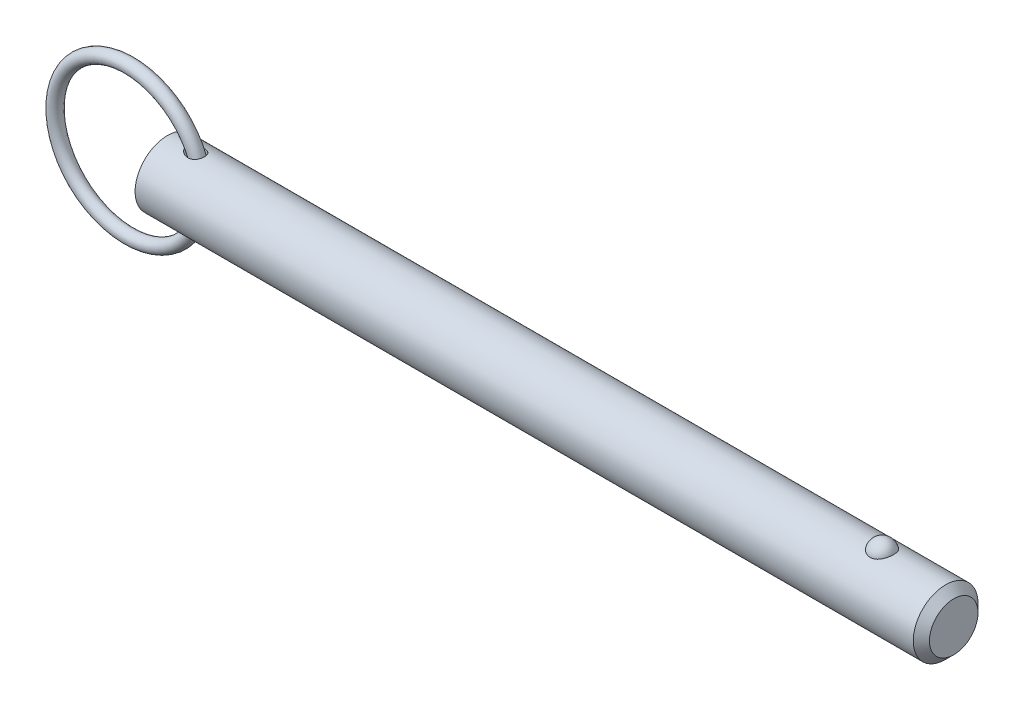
ISO-10303-21;
HEADER;
FILE_DESCRIPTION(('STEP AP214'),'2;1');
FILE_NAME('part.step','',(''),(''),'','','');
FILE_SCHEMA(('AUTOMOTIVE_DESIGN { 1 0 10303 214 1 1 1 1 }'));
ENDSEC;
DATA;
#1=APPLICATION_CONTEXT('core data for automotive mechanical design processes');
#2=APPLICATION_PROTOCOL_DEFINITION('international standard','automotive_design',2000,#1);
#3=PRODUCT_CONTEXT('',#1,'mechanical');
#4=PRODUCT('Part','Part','',(#3));
#5=PRODUCT_RELATED_PRODUCT_CATEGORY('part','',(#4));
#6=PRODUCT_DEFINITION_FORMATION('','',#4);
#7=PRODUCT_DEFINITION_CONTEXT('part definition',#1,'design');
#8=PRODUCT_DEFINITION('design','',#6,#7);
#9=PRODUCT_DEFINITION_SHAPE('','',#8);
#10=(LENGTH_UNIT() NAMED_UNIT(*) SI_UNIT(.MILLI.,.METRE.));
#11=(NAMED_UNIT(*) PLANE_ANGLE_UNIT() SI_UNIT($,.RADIAN.));
#12=(NAMED_UNIT(*) SI_UNIT($,.STERADIAN.) SOLID_ANGLE_UNIT());
#13=UNCERTAINTY_MEASURE_WITH_UNIT(LENGTH_MEASURE(1.E-05),#10,'distance_accuracy_value','');
#14=(GEOMETRIC_REPRESENTATION_CONTEXT(3) GLOBAL_UNCERTAINTY_ASSIGNED_CONTEXT((#13)) GLOBAL_UNIT_ASSIGNED_CONTEXT((#10,
#11,#12)) REPRESENTATION_CONTEXT('',''));
#15=CARTESIAN_POINT('',(0.,0.,0.));
#16=DIRECTION('',(0.,0.,1.));
#17=DIRECTION('',(1.,0.,0.));
#18=AXIS2_PLACEMENT_3D('',#15,#16,#17);
#19=CARTESIAN_POINT('',(-6.5973878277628,0.,0.));
#20=DIRECTION('',(0.,0.,1.));
#21=DIRECTION('',(1.,0.,0.));
#22=AXIS2_PLACEMENT_3D('',#19,#20,#21);
#23=TOROIDAL_SURFACE('',#22,12.7,1.111);
#24=CARTESIAN_POINT('',(7.21361217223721,0.,0.));
#25=VERTEX_POINT('',#24);
#26=VERTEX_LOOP('',#25);
#27=FACE_BOUND('',#26,.T.);
#28=ADVANCED_FACE('P0_F12',(#27),#23,.T.);
#29=CLOSED_SHELL('',(#28));
#30=MANIFOLD_SOLID_BREP('P0_B1',#29);
#31=CARTESIAN_POINT('',(0.,0.,0.));
#32=DIRECTION('',(1.,0.,0.));
#33=DIRECTION('',(0.,0.,-1.));
#34=AXIS2_PLACEMENT_3D('',#31,#32,#33);
#35=CYLINDRICAL_SURFACE('',#34,5.555);
#36=CARTESIAN_POINT('',(3.4079629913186,5.52646850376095,-0.56229074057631));
#37=CARTESIAN_POINT('',(3.45038002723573,5.51879026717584,-0.637753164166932));
#38=CARTESIAN_POINT('',(3.50032814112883,5.50998541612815,-0.70889136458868));
#39=CARTESIAN_POINT('',(3.61174203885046,5.49132550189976,-0.841353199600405));
#40=CARTESIAN_POINT('',(3.67323300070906,5.48146816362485,-0.902654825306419));
#41=CARTESIAN_POINT('',(3.80437942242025,5.46186986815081,-1.01449227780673));
#42=CARTESIAN_POINT('',(3.87396236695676,5.45212862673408,-1.06511378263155));
#43=CARTESIAN_POINT('',(4.01965973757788,5.43359578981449,-1.15594541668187));
#44=CARTESIAN_POINT('',(4.09577226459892,5.42480391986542,-1.19615855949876));
#45=CARTESIAN_POINT('',(4.26620236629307,5.40764958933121,-1.27165209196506));
#46=CARTESIAN_POINT('',(4.36143030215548,5.3996073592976,-1.30496908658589));
#47=CARTESIAN_POINT('',(4.55632904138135,5.38707461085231,-1.35578120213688));
#48=CARTESIAN_POINT('',(4.65600230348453,5.38258608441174,-1.37326745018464));
#49=CARTESIAN_POINT('',(4.85802759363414,5.37803111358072,-1.3910078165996));
#50=CARTESIAN_POINT('',(4.96039620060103,5.37800782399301,-1.39109376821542));
#51=CARTESIAN_POINT('',(5.16321961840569,5.38288845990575,-1.37209481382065));
#52=CARTESIAN_POINT('',(5.26367660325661,5.38778639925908,-1.3530331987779));
#53=CARTESIAN_POINT('',(5.44616808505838,5.40112654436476,-1.29866014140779));
#54=CARTESIAN_POINT('',(5.52893514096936,5.40904875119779,-1.26567968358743));
#55=CARTESIAN_POINT('',(5.68656142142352,5.4273273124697,-1.18484144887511));
#56=CARTESIAN_POINT('',(5.76142575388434,5.43768208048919,-1.13699336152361));
#57=CARTESIAN_POINT('',(5.8928378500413,5.45821422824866,-1.03362464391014));
#58=CARTESIAN_POINT('',(5.95048930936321,5.4682911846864,-0.979480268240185));
#59=CARTESIAN_POINT('',(6.05543937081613,5.48805232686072,-0.861887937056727));
#60=CARTESIAN_POINT('',(6.10274018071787,5.4977365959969,-0.798441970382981));
#61=CARTESIAN_POINT('',(6.18429732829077,5.51527779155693,-0.666351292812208));
#62=CARTESIAN_POINT('',(6.2189304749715,5.52318421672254,-0.597945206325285));
#63=CARTESIAN_POINT('',(6.27643902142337,5.53669785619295,-0.456146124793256));
#64=CARTESIAN_POINT('',(6.299314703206,5.54230512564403,-0.382753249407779));
#65=CARTESIAN_POINT('',(6.33280284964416,5.55061821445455,-0.232999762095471));
#66=CARTESIAN_POINT('',(6.34340498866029,5.55332159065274,-0.156636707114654));
#67=CARTESIAN_POINT('',(6.35208224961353,5.55552923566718,-0.00315477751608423));
#68=CARTESIAN_POINT('',(6.3501570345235,5.55503341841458,0.0739641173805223));
#69=CARTESIAN_POINT('',(6.33379320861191,5.55088854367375,0.22702996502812));
#70=CARTESIAN_POINT('',(6.31931424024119,5.54722931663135,0.302972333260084));
#71=CARTESIAN_POINT('',(6.27810810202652,5.53713917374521,0.451265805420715));
#72=CARTESIAN_POINT('',(6.25138106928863,5.53070828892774,0.523616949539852));
#73=CARTESIAN_POINT('',(6.18634700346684,5.51578851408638,0.662556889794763));
#74=CARTESIAN_POINT('',(6.14805666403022,5.50730259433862,0.729153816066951));
#75=CARTESIAN_POINT('',(6.0608417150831,5.4892059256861,0.854797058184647));
#76=CARTESIAN_POINT('',(6.01191805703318,5.47959527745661,0.91384404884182));
#77=CARTESIAN_POINT('',(5.90496974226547,5.46035411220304,1.0225462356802));
#78=CARTESIAN_POINT('',(5.84698163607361,5.45072382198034,1.07223745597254));
#79=CARTESIAN_POINT('',(5.72342907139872,5.43245016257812,1.16128533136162));
#80=CARTESIAN_POINT('',(5.65786492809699,5.42380675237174,1.20064241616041));
#81=CARTESIAN_POINT('',(5.52033184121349,5.40830592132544,1.26865612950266));
#82=CARTESIAN_POINT('',(5.44830127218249,5.40146883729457,1.29719236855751));
#83=CARTESIAN_POINT('',(5.30051649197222,5.39032432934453,1.34275086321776));
#84=CARTESIAN_POINT('',(5.22476137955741,5.38601752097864,1.35977031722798));
#85=CARTESIAN_POINT('',(5.06697568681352,5.38004503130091,1.3832203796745));
#86=CARTESIAN_POINT('',(4.98483834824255,5.37854992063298,1.38896799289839));
#87=CARTESIAN_POINT('',(4.82062075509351,5.37866467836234,1.38851901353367));
#88=CARTESIAN_POINT('',(4.73854053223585,5.38027567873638,1.38231806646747));
#89=CARTESIAN_POINT('',(4.56659703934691,5.38661928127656,1.35740374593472));
#90=CARTESIAN_POINT('',(4.47694676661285,5.39169506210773,1.33731128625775));
#91=CARTESIAN_POINT('',(4.30168169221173,5.40457769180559,1.28425210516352));
#92=CARTESIAN_POINT('',(4.2160714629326,5.41238755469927,1.25127117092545));
#93=CARTESIAN_POINT('',(4.04117722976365,5.43085841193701,1.16867508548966));
#94=CARTESIAN_POINT('',(3.95261220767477,5.44174460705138,1.11757796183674));
#95=CARTESIAN_POINT('',(3.78568183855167,5.46440376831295,1.00091858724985));
#96=CARTESIAN_POINT('',(3.70730710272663,5.47617590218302,0.935369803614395));
#97=CARTESIAN_POINT('',(3.5829937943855,5.49603821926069,0.809043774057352));
#98=CARTESIAN_POINT('',(3.5339020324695,5.50429522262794,0.751392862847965));
#99=CARTESIAN_POINT('',(3.44556991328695,5.51963490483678,0.628847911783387));
#100=CARTESIAN_POINT('',(3.40631385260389,5.52671944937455,0.563965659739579));
#101=CARTESIAN_POINT('',(3.34553998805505,5.5379053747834,0.439181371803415));
#102=CARTESIAN_POINT('',(3.32216705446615,5.5423057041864,0.380214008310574));
#103=CARTESIAN_POINT('',(3.2854368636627,5.54928356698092,0.259119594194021));
#104=CARTESIAN_POINT('',(3.27207322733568,5.5518622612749,0.196994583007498));
#105=CARTESIAN_POINT('',(3.25633559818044,5.5549036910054,0.0710541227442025));
#106=CARTESIAN_POINT('',(3.25400356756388,5.5553583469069,0.00723314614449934));
#107=CARTESIAN_POINT('',(3.26064251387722,5.55407150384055,-0.119787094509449));
#108=CARTESIAN_POINT('',(3.26961302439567,5.55233009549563,-0.182986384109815));
#109=CARTESIAN_POINT('',(3.29666795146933,5.54714559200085,-0.30051820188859));
#110=CARTESIAN_POINT('',(3.31373453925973,5.54389322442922,-0.355099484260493));
#111=CARTESIAN_POINT('',(3.35543396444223,5.53607951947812,-0.461174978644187));
#112=CARTESIAN_POINT('',(3.38007019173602,5.5315175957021,-0.512667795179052));
#113=CARTESIAN_POINT('',(3.4079629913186,5.52646850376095,-0.56229074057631));
#114=B_SPLINE_CURVE_WITH_KNOTS('',3,(#36,#37,#38,#39,#40,#41,#42,#43,#44,#45,#46,#47,#48,#49,
#50,#51,#52,#53,#54,#55,#56,#57,#58,#59,#60,#61,#62,#63,#64,#65,#66,#67,#68,#69,#70,#71,#72,#73,
#74,#75,#76,#77,#78,#79,#80,#81,#82,#83,#84,#85,#86,#87,#88,#89,#90,#91,#92,#93,#94,#95,#96,#97,
#98,#99,#100,#101,#102,#103,#104,#105,#106,#107,#108,#109,#110,#111,#112,#113),.UNSPECIFIED.,
.T.,.F.,(4,2,2,2,2,2,2,2,2,2,2,2,2,2,2,2,2,2,2,2,2,2,2,2,2,2,2,2,2,2,2,2,2,2,2,2,2,2,4),(0.,
0.260459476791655,0.521493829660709,0.780346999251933,1.03912513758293,1.34137402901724,
1.64379222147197,1.94913302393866,2.25410286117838,2.52092363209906,2.78757087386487,
3.0255756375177,3.26352958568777,3.49368251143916,3.72382991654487,3.9541708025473,
4.18451788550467,4.41560824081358,4.64669600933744,4.87745174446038,5.10818684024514,
5.33801446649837,5.56783253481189,5.80013729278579,6.03249854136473,6.27855081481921,
6.5246927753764,6.79963372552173,7.07487872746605,7.38193573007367,7.68870779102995,
7.91639390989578,8.14371416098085,8.33366541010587,8.52349549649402,8.71404708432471,
8.90459080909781,9.07578823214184,9.24706243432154),.UNSPECIFIED.);
#115=CARTESIAN_POINT('',(3.4079629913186,5.52646850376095,-0.56229074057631));
#116=VERTEX_POINT('',#115);
#117=EDGE_CURVE('P1_E40',#116,#116,#114,.T.);
#118=ORIENTED_EDGE('',*,*,#117,.T.);
#119=EDGE_LOOP('',(#118));
#120=FACE_BOUND('',#119,.T.);
#121=CARTESIAN_POINT('',(133.53125,0.,0.));
#122=DIRECTION('',(1.,0.,0.));
#123=DIRECTION('',(0.,0.,-1.));
#124=AXIS2_PLACEMENT_3D('',#121,#122,#123);
#125=CIRCLE('',#124,5.555);
#126=CARTESIAN_POINT('',(133.53125,0.,-5.555));
#127=VERTEX_POINT('',#126);
#128=EDGE_CURVE('P1_E25',#127,#127,#125,.T.);
#129=ORIENTED_EDGE('',*,*,#128,.F.);
#130=EDGE_LOOP('',(#129));
#131=FACE_BOUND('',#130,.T.);
#132=CARTESIAN_POINT('',(0.,0.,0.));
#133=DIRECTION('',(1.,0.,0.));
#134=DIRECTION('',(0.,0.,-1.));
#135=AXIS2_PLACEMENT_3D('',#132,#133,#134);
#136=CIRCLE('',#135,5.555);
#137=CARTESIAN_POINT('',(0.,0.,-5.555));
#138=VERTEX_POINT('',#137);
#139=EDGE_CURVE('P1_E9',#138,#138,#136,.T.);
#140=ORIENTED_EDGE('',*,*,#139,.T.);
#141=EDGE_LOOP('',(#140));
#142=FACE_BOUND('',#141,.T.);
#143=CARTESIAN_POINT('',(122.618626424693,5.16741224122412,2.03859650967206));
#144=CARTESIAN_POINT('',(122.512949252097,5.16740893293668,2.03859990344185));
#145=CARTESIAN_POINT('',(122.40729894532,5.17079470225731,2.03008306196));
#146=CARTESIAN_POINT('',(122.199141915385,5.18392795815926,1.99630721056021));
#147=CARTESIAN_POINT('',(122.096634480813,5.19367399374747,1.97105201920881));
#148=CARTESIAN_POINT('',(121.897771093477,5.21839168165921,1.90463997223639));
#149=CARTESIAN_POINT('',(121.801406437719,5.23335573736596,1.86350622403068));
#150=CARTESIAN_POINT('',(121.617080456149,5.26688076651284,1.76652592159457));
#151=CARTESIAN_POINT('',(121.529120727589,5.28544242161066,1.71067657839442));
#152=CARTESIAN_POINT('',(121.361265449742,5.32479845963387,1.58399959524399));
#153=CARTESIAN_POINT('',(121.28166564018,5.34564089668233,1.51279545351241));
#154=CARTESIAN_POINT('',(121.13512901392,5.38697258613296,1.35828584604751));
#155=CARTESIAN_POINT('',(121.068194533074,5.40746177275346,1.27497815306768));
#156=CARTESIAN_POINT('',(120.94561039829,5.44694508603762,1.09440293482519));
#157=CARTESIAN_POINT('',(120.890598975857,5.46583143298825,0.996677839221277));
#158=CARTESIAN_POINT('',(120.796937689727,5.49908030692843,0.79296193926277));
#159=CARTESIAN_POINT('',(120.758289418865,5.513442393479,0.686970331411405));
#160=CARTESIAN_POINT('',(120.697680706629,5.536358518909,0.468019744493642));
#161=CARTESIAN_POINT('',(120.675972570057,5.54482455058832,0.354981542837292));
#162=CARTESIAN_POINT('',(120.650636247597,5.55473324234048,0.126595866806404));
#163=CARTESIAN_POINT('',(120.647007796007,5.55617600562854,0.0112484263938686));
#164=CARTESIAN_POINT('',(120.657881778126,5.55189984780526,-0.218011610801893));
#165=CARTESIAN_POINT('',(120.672315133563,5.54620821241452,-0.331928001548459));
#166=CARTESIAN_POINT('',(120.718903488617,5.52828920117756,-0.555544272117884));
#167=CARTESIAN_POINT('',(120.751058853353,5.5160616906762,-0.665244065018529));
#168=CARTESIAN_POINT('',(120.832488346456,5.48630779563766,-0.877469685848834));
#169=CARTESIAN_POINT('',(120.881781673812,5.4687754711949,-0.979987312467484));
#170=CARTESIAN_POINT('',(120.996478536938,5.43024700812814,-1.17486975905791));
#171=CARTESIAN_POINT('',(121.061883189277,5.4092506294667,-1.26723387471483));
#172=CARTESIAN_POINT('',(121.207571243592,5.36600927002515,-1.43940133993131));
#173=CARTESIAN_POINT('',(121.287885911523,5.34376173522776,-1.51917763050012));
#174=CARTESIAN_POINT('',(121.461452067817,5.30057971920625,-1.66360338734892));
#175=CARTESIAN_POINT('',(121.554702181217,5.27964509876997,-1.72825445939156));
#176=CARTESIAN_POINT('',(121.749393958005,5.24205250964,-1.83909478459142));
#177=CARTESIAN_POINT('',(121.850590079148,5.22530519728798,-1.88568407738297));
#178=CARTESIAN_POINT('',(122.060155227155,5.19750919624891,-1.96100802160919));
#179=CARTESIAN_POINT('',(122.168521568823,5.1864583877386,-1.98974931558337));
#180=CARTESIAN_POINT('',(122.383498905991,5.17184410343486,-2.02742262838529));
#181=CARTESIAN_POINT('',(122.489925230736,5.1679328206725,-2.03727608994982));
#182=CARTESIAN_POINT('',(122.702992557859,5.16698995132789,-2.03966777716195));
#183=CARTESIAN_POINT('',(122.809633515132,5.16995704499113,-2.03220932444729));
#184=CARTESIAN_POINT('',(123.016773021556,5.18222383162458,-2.00071170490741));
#185=CARTESIAN_POINT('',(123.117359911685,5.19133213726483,-1.97717337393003));
#186=CARTESIAN_POINT('',(123.313014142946,5.21467637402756,-1.91475248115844));
#187=CARTESIAN_POINT('',(123.408081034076,5.22891272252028,-1.8758686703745));
#188=CARTESIAN_POINT('',(123.592371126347,5.26137066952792,-1.7828271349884));
#189=CARTESIAN_POINT('',(123.681419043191,5.27967329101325,-1.72835124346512));
#190=CARTESIAN_POINT('',(123.849288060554,5.31817411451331,-1.6059748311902));
#191=CARTESIAN_POINT('',(123.928106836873,5.33837274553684,-1.53807126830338));
#192=CARTESIAN_POINT('',(124.077515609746,5.37968287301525,-1.38688970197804));
#193=CARTESIAN_POINT('',(124.147505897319,5.40079011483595,-1.30301744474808));
#194=CARTESIAN_POINT('',(124.273012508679,5.44074401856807,-1.12458170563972));
#195=CARTESIAN_POINT('',(124.328526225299,5.4595902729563,-1.03001630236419));
#196=CARTESIAN_POINT('',(124.425550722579,5.49369849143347,-0.829439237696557));
#197=CARTESIAN_POINT('',(124.466548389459,5.50882422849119,-0.723155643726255));
#198=CARTESIAN_POINT('',(124.531125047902,5.53310911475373,-0.504772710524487));
#199=CARTESIAN_POINT('',(124.554703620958,5.54226812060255,-0.392673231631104));
#200=CARTESIAN_POINT('',(124.584013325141,5.55370358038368,-0.165459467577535));
#201=CARTESIAN_POINT('',(124.589688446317,5.55595843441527,-0.0503368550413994));
#202=CARTESIAN_POINT('',(124.582916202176,5.55329317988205,0.179288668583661));
#203=CARTESIAN_POINT('',(124.570469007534,5.54837313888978,0.29379158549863));
#204=CARTESIAN_POINT('',(124.527779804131,5.53189037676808,0.51852641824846));
#205=CARTESIAN_POINT('',(124.497598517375,5.5203503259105,0.628771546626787));
#206=CARTESIAN_POINT('',(124.420096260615,5.49182453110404,0.842318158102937));
#207=CARTESIAN_POINT('',(124.372774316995,5.47483847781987,0.945619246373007));
#208=CARTESIAN_POINT('',(124.261720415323,5.43710633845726,1.14281571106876));
#209=CARTESIAN_POINT('',(124.197921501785,5.41634501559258,1.23667048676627));
#210=CARTESIAN_POINT('',(124.055357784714,5.37334572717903,1.41185243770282));
#211=CARTESIAN_POINT('',(123.97659323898,5.35110778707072,1.4931798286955));
#212=CARTESIAN_POINT('',(123.806423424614,5.30779474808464,1.64049162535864));
#213=CARTESIAN_POINT('',(123.71510026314,5.28671324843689,1.70656877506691));
#214=CARTESIAN_POINT('',(123.521739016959,5.24804852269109,1.82201372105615));
#215=CARTESIAN_POINT('',(123.419700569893,5.23046541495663,1.87138095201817));
#216=CARTESIAN_POINT('',(123.203618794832,5.20042692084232,1.95335298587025));
#217=CARTESIAN_POINT('',(123.089260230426,5.18820192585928,1.98521734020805));
#218=CARTESIAN_POINT('',(122.856130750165,5.17169804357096,2.02783294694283));
#219=CARTESIAN_POINT('',(122.737361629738,5.16741595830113,2.03859269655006));
#220=CARTESIAN_POINT('',(122.618626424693,5.16741224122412,2.03859650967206));
#221=B_SPLINE_CURVE_WITH_KNOTS('',3,(#143,#144,#145,#146,#147,#148,#149,#150,#151,#152,#153,
#154,#155,#156,#157,#158,#159,#160,#161,#162,#163,#164,#165,#166,#167,#168,#169,#170,#171,#172,
#173,#174,#175,#176,#177,#178,#179,#180,#181,#182,#183,#184,#185,#186,#187,#188,#189,#190,#191,
#192,#193,#194,#195,#196,#197,#198,#199,#200,#201,#202,#203,#204,#205,#206,#207,#208,#209,#210,
#211,#212,#213,#214,#215,#216,#217,#218,#219,#220),.UNSPECIFIED.,.T.,.F.,(4,2,2,2,2,2,2,2,2,2,2,
2,2,2,2,2,2,2,2,2,2,2,2,2,2,2,2,2,2,2,2,2,2,2,2,2,2,2,4),(0.,0.316595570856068,
0.633118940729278,0.949183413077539,1.26530783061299,1.59030762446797,1.91536729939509,
2.25495824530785,2.59458224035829,2.93917283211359,3.28375835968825,3.62703002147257,
3.97030875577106,4.31397329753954,4.65766166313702,5.00207904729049,5.34645984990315,
5.68270547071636,6.01882587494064,6.33808403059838,6.65728093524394,6.96696376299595,
7.27667180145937,7.59321535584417,7.909830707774,8.24210387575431,8.57443684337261,
8.91755896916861,9.26068933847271,9.60489211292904,9.94909164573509,10.2921194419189,
10.6351667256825,10.9796305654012,11.3240884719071,11.6663928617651,12.0087088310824,
12.3645679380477,12.7202837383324),.UNSPECIFIED.);
#222=CARTESIAN_POINT('',(122.618626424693,5.16741224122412,2.03859650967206));
#223=VERTEX_POINT('',#222);
#224=EDGE_CURVE('P1_E34',#223,#223,#221,.T.);
#225=ORIENTED_EDGE('',*,*,#224,.T.);
#226=EDGE_LOOP('',(#225));
#227=FACE_BOUND('',#226,.T.);
#228=CARTESIAN_POINT('',(3.4079629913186,-5.52646850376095,-0.56229074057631));
#229=CARTESIAN_POINT('',(3.37716927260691,-5.53204268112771,-0.507507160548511));
#230=CARTESIAN_POINT('',(3.35034276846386,-5.53702335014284,-0.450440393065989));
#231=CARTESIAN_POINT('',(3.30606625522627,-5.54534377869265,-0.3326552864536));
#232=CARTESIAN_POINT('',(3.28860803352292,-5.5486849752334,-0.271940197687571));
#233=CARTESIAN_POINT('',(3.2642120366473,-5.55337514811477,-0.148013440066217));
#234=CARTESIAN_POINT('',(3.25732647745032,-5.55471423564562,-0.0847909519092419));
#235=CARTESIAN_POINT('',(3.25480623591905,-5.5552029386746,0.0418913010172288));
#236=CARTESIAN_POINT('',(3.25917102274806,-5.55435265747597,0.105351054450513));
#237=CARTESIAN_POINT('',(3.27824306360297,-5.55067444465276,0.227039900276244));
#238=CARTESIAN_POINT('',(3.29237198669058,-5.54795714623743,0.285365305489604));
#239=CARTESIAN_POINT('',(3.32941044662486,-5.54094262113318,0.399033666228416));
#240=CARTESIAN_POINT('',(3.3523223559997,-5.53664496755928,0.454375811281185));
#241=CARTESIAN_POINT('',(3.40768868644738,-5.52648234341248,0.56509977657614));
#242=CARTESIAN_POINT('',(3.44072521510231,-5.52052470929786,0.620179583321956));
#243=CARTESIAN_POINT('',(3.51400705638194,-5.50771567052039,0.725188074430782));
#244=CARTESIAN_POINT('',(3.55425830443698,-5.50086353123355,0.775112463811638));
#245=CARTESIAN_POINT('',(3.66122818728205,-5.48337209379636,0.891977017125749));
#246=CARTESIAN_POINT('',(3.73142715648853,-5.47248221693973,0.955709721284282));
#247=CARTESIAN_POINT('',(3.88137100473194,-5.45112279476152,1.07085228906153));
#248=CARTESIAN_POINT('',(3.96113047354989,-5.44065392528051,1.12224294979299));
#249=CARTESIAN_POINT('',(4.12858826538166,-5.42121387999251,1.21269344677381));
#250=CARTESIAN_POINT('',(4.21635930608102,-5.41225908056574,1.25162207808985));
#251=CARTESIAN_POINT('',(4.39702156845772,-5.39704895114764,1.31566440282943));
#252=CARTESIAN_POINT('',(4.48991226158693,-5.39079334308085,1.34077951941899));
#253=CARTESIAN_POINT('',(4.68604255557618,-5.38154547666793,1.37745897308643));
#254=CARTESIAN_POINT('',(4.78952677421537,-5.37884317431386,1.38782444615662));
#255=CARTESIAN_POINT('',(4.9967070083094,-5.3783992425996,1.38955482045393));
#256=CARTESIAN_POINT('',(5.10040282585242,-5.380654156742,1.380932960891));
#257=CARTESIAN_POINT('',(5.29344112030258,-5.3896561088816,1.34533259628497));
#258=CARTESIAN_POINT('',(5.38316618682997,-5.39591960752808,1.32032381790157));
#259=CARTESIAN_POINT('',(5.55593681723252,-5.41176992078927,1.25376768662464));
#260=CARTESIAN_POINT('',(5.63898852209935,-5.42135363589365,1.2122357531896));
#261=CARTESIAN_POINT('',(5.78518175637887,-5.4411584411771,1.1197110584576));
#262=CARTESIAN_POINT('',(5.84951468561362,-5.45115126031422,1.07054233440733));
#263=CARTESIAN_POINT('',(5.96832363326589,-5.47143247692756,0.961516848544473));
#264=CARTESIAN_POINT('',(6.02280238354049,-5.48172079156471,0.901663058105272));
#265=CARTESIAN_POINT('',(6.11773365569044,-5.50082367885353,0.776380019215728));
#266=CARTESIAN_POINT('',(6.15876077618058,-5.50968670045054,0.711392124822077));
#267=CARTESIAN_POINT('',(6.22940016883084,-5.52555592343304,0.575278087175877));
#268=CARTESIAN_POINT('',(6.25901321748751,-5.53256225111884,0.504152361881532));
#269=CARTESIAN_POINT('',(6.30603044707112,-5.54392803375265,0.35809068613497));
#270=CARTESIAN_POINT('',(6.32348246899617,-5.54829785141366,0.283170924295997));
#271=CARTESIAN_POINT('',(6.34598368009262,-5.5539654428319,0.131376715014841));
#272=CARTESIAN_POINT('',(6.35103253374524,-5.55526313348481,0.0545022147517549));
#273=CARTESIAN_POINT('',(6.34861245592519,-5.55464639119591,-0.0993401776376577));
#274=CARTESIAN_POINT('',(6.34109421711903,-5.5527193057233,-0.176307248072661));
#275=CARTESIAN_POINT('',(6.31360904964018,-5.54583593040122,-0.327847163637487));
#276=CARTESIAN_POINT('',(6.29364207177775,-5.54087962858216,-0.402419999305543));
#277=CARTESIAN_POINT('',(6.24170966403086,-5.52847553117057,-0.547041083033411));
#278=CARTESIAN_POINT('',(6.20974488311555,-5.52102787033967,-0.617089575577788));
#279=CARTESIAN_POINT('',(6.13458425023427,-5.5044595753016,-0.750655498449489));
#280=CARTESIAN_POINT('',(6.09138916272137,-5.49533905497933,-0.814173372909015));
#281=CARTESIAN_POINT('',(5.99508306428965,-5.47647644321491,-0.932642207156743));
#282=CARTESIAN_POINT('',(5.94201288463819,-5.46673701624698,-0.987626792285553));
#283=CARTESIAN_POINT('',(5.82732079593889,-5.4476756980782,-1.08787197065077));
#284=CARTESIAN_POINT('',(5.76569959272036,-5.43835377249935,-1.133133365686));
#285=CARTESIAN_POINT('',(5.63545565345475,-5.42108746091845,-1.2130627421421));
#286=CARTESIAN_POINT('',(5.56680798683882,-5.41314827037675,-1.24769112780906));
#287=CARTESIAN_POINT('',(5.42470366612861,-5.39946749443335,-1.30562834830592));
#288=CARTESIAN_POINT('',(5.35124627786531,-5.39372624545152,-1.32893545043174));
#289=CARTESIAN_POINT('',(5.19834649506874,-5.38471871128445,-1.36498831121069));
#290=CARTESIAN_POINT('',(5.11878242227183,-5.38156800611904,-1.37724301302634));
#291=CARTESIAN_POINT('',(4.95867408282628,-5.37830368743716,-1.38993264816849));
#292=CARTESIAN_POINT('',(4.87812945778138,-5.37819121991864,-1.39036312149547));
#293=CARTESIAN_POINT('',(4.70952450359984,-5.38096665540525,-1.37958681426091));
#294=CARTESIAN_POINT('',(4.62154757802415,-5.38416579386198,-1.36717293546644));
#295=CARTESIAN_POINT('',(4.44844201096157,-5.39350862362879,-1.32983172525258));
#296=CARTESIAN_POINT('',(4.36331534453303,-5.39965431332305,-1.30489590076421));
#297=CARTESIAN_POINT('',(4.18705584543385,-5.41508127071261,-1.23943340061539));
#298=CARTESIAN_POINT('',(4.09653169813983,-5.42466147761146,-1.19732979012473));
#299=CARTESIAN_POINT('',(3.92355621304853,-5.44542654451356,-1.09903394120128));
#300=CARTESIAN_POINT('',(3.84111059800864,-5.45661252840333,-1.04283181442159));
#301=CARTESIAN_POINT('',(3.69303712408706,-5.47835672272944,-0.921492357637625));
#302=CARTESIAN_POINT('',(3.62661543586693,-5.4888999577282,-0.857326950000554));
#303=CARTESIAN_POINT('',(3.50663841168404,-5.50887375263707,-0.717815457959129));
#304=CARTESIAN_POINT('',(3.45304856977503,-5.51830726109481,-0.642500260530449));
#305=CARTESIAN_POINT('',(3.4079629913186,-5.52646850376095,-0.56229074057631));
#306=B_SPLINE_CURVE_WITH_KNOTS('',3,(#228,#229,#230,#231,#232,#233,#234,#235,#236,#237,#238,
#239,#240,#241,#242,#243,#244,#245,#246,#247,#248,#249,#250,#251,#252,#253,#254,#255,#256,#257,
#258,#259,#260,#261,#262,#263,#264,#265,#266,#267,#268,#269,#270,#271,#272,#273,#274,#275,#276,
#277,#278,#279,#280,#281,#282,#283,#284,#285,#286,#287,#288,#289,#290,#291,#292,#293,#294,#295,
#296,#297,#298,#299,#300,#301,#302,#303,#304,#305),.UNSPECIFIED.,.T.,.F.,(4,2,2,2,2,2,2,2,2,2,2,
2,2,2,2,2,2,2,2,2,2,2,2,2,2,2,2,2,2,2,2,2,2,2,2,2,2,2,4),(0.,0.189054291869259,
0.377942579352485,0.567760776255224,0.757570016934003,0.937004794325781,1.11648807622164,
1.30929480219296,1.50226088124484,1.78704908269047,2.07227755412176,2.3604171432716,
2.64852704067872,2.95892962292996,3.26911584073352,3.5475451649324,3.82571526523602,
4.06921935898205,4.31265584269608,4.54364944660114,4.77462733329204,5.00469135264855,
5.23476159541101,5.46573664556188,5.69671260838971,5.92767607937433,6.15862383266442,
6.38863707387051,6.61863134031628,6.84947196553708,7.08034790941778,7.32103794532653,
7.56181876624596,7.82747997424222,8.09332161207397,8.39289891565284,8.69268692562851,
8.97023931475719,9.24703674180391),.UNSPECIFIED.);
#307=CARTESIAN_POINT('',(3.4079629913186,-5.52646850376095,-0.56229074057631));
#308=VERTEX_POINT('',#307);
#309=EDGE_CURVE('P1_E17',#308,#308,#306,.T.);
#310=ORIENTED_EDGE('',*,*,#309,.T.);
#311=EDGE_LOOP('',(#310));
#312=FACE_BOUND('',#311,.T.);
#313=ADVANCED_FACE('P1_F13',(#120,#131,#142,#227,#312),#35,.T.);
#314=CARTESIAN_POINT('',(0.,0.,0.));
#315=DIRECTION('',(-1.,0.,0.));
#316=DIRECTION('',(0.,0.,1.));
#317=AXIS2_PLACEMENT_3D('',#314,#315,#316);
#318=PLANE('',#317);
#319=ORIENTED_EDGE('',*,*,#139,.F.);
#320=EDGE_LOOP('',(#319));
#321=FACE_BOUND('',#320,.T.);
#322=ADVANCED_FACE('P1_F15',(#321),#318,.T.);
#323=CARTESIAN_POINT('',(134.92,0.,0.));
#324=DIRECTION('',(-1.,0.,0.));
#325=DIRECTION('',(0.,0.,1.));
#326=AXIS2_PLACEMENT_3D('',#323,#324,#325);
#327=CONICAL_SURFACE('',#326,4.16625000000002,0.785398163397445);
#328=ORIENTED_EDGE('',*,*,#128,.T.);
#329=EDGE_LOOP('',(#328));
#330=FACE_BOUND('',#329,.T.);
#331=CARTESIAN_POINT('',(134.92,0.,0.));
#332=DIRECTION('',(1.,0.,0.));
#333=DIRECTION('',(0.,0.,-1.));
#334=AXIS2_PLACEMENT_3D('',#331,#332,#333);
#335=CIRCLE('',#334,4.16625000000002);
#336=CARTESIAN_POINT('',(134.92,0.,-4.16625000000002));
#337=VERTEX_POINT('',#336);
#338=EDGE_CURVE('P1_E30',#337,#337,#335,.T.);
#339=ORIENTED_EDGE('',*,*,#338,.F.);
#340=EDGE_LOOP('',(#339));
#341=FACE_BOUND('',#340,.T.);
#342=ADVANCED_FACE('P1_F55',(#330,#341),#327,.T.);
#343=CARTESIAN_POINT('',(134.92,4.16625000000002,0.));
#344=DIRECTION('',(1.,0.,0.));
#345=DIRECTION('',(0.,0.,-1.));
#346=AXIS2_PLACEMENT_3D('',#343,#344,#345);
#347=PLANE('',#346);
#348=ORIENTED_EDGE('',*,*,#338,.T.);
#349=EDGE_LOOP('',(#348));
#350=FACE_BOUND('',#349,.T.);
#351=ADVANCED_FACE('P1_F51',(#350),#347,.T.);
#352=CARTESIAN_POINT('',(122.618626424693,4.9995,0.));
#353=DIRECTION('',(-1.,0.,0.));
#354=DIRECTION('',(0.,1.,0.));
#355=AXIS2_PLACEMENT_3D('',#352,#353,#354);
#356=SPHERICAL_SURFACE('',#355,2.04550000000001);
#357=ORIENTED_EDGE('',*,*,#224,.F.);
#358=EDGE_LOOP('',(#357));
#359=FACE_BOUND('',#358,.T.);
#360=ADVANCED_FACE('P1_F46',(#359),#356,.T.);
#361=CARTESIAN_POINT('',(-6.59738782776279,0.,0.));
#362=DIRECTION('',(0.,0.,1.));
#363=DIRECTION('',(1.,0.,0.));
#364=AXIS2_PLACEMENT_3D('',#361,#362,#363);
#365=TOROIDAL_SURFACE('',#364,12.7,1.38875);
#366=ORIENTED_EDGE('',*,*,#309,.F.);
#367=EDGE_LOOP('',(#366));
#368=FACE_BOUND('',#367,.T.);
#369=ORIENTED_EDGE('',*,*,#117,.F.);
#370=EDGE_LOOP('',(#369));
#371=FACE_BOUND('',#370,.T.);
#372=ADVANCED_FACE('P1_F50',(#368,#371),#365,.F.);
#373=CLOSED_SHELL('',(#313,#322,#342,#351,#360,#372));
#374=MANIFOLD_SOLID_BREP('P1_B1',#373);
#375=ADVANCED_BREP_SHAPE_REPRESENTATION('',(#18,#30,#374),#14);
#376=SHAPE_DEFINITION_REPRESENTATION(#9,#375);
ENDSEC;
END-ISO-10303-21;
